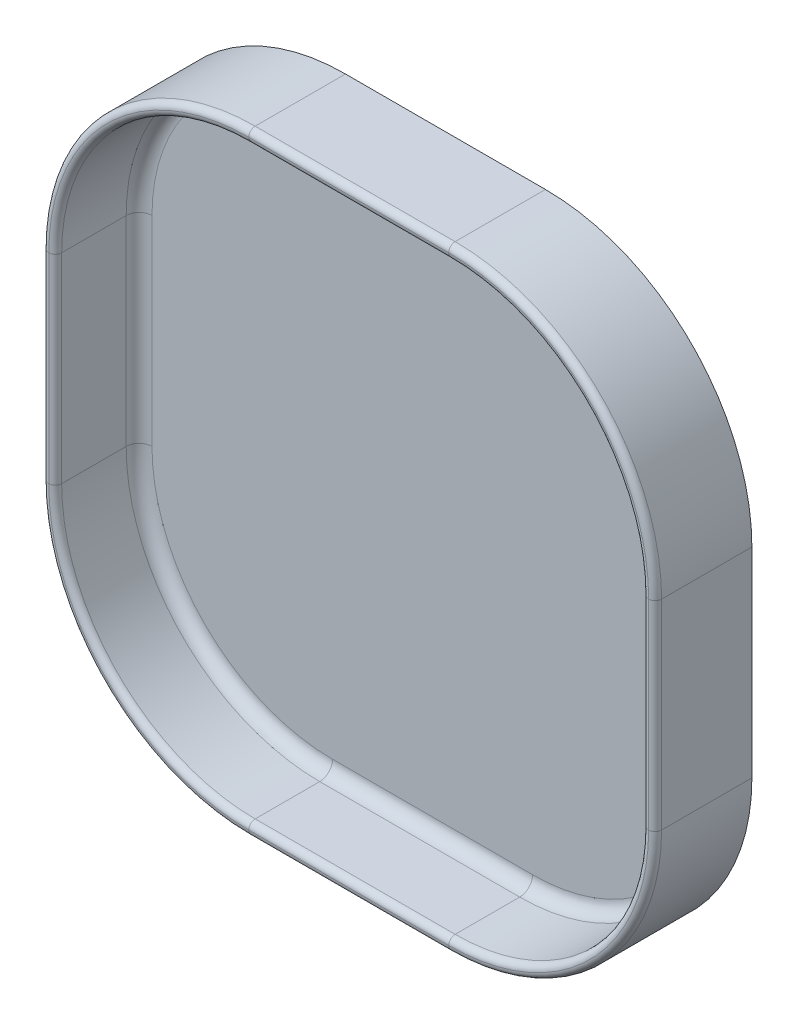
ISO-10303-21;
HEADER;
FILE_DESCRIPTION(('STEP AP214'),'2;1');
FILE_NAME('part.step','',(''),(''),'','','');
FILE_SCHEMA(('AUTOMOTIVE_DESIGN { 1 0 10303 214 1 1 1 1 }'));
ENDSEC;
DATA;
#1=APPLICATION_CONTEXT('core data for automotive mechanical design processes');
#2=APPLICATION_PROTOCOL_DEFINITION('international standard','automotive_design',2000,#1);
#3=PRODUCT_CONTEXT('',#1,'mechanical');
#4=PRODUCT('Part','Part','',(#3));
#5=PRODUCT_RELATED_PRODUCT_CATEGORY('part','',(#4));
#6=PRODUCT_DEFINITION_FORMATION('','',#4);
#7=PRODUCT_DEFINITION_CONTEXT('part definition',#1,'design');
#8=PRODUCT_DEFINITION('design','',#6,#7);
#9=PRODUCT_DEFINITION_SHAPE('','',#8);
#10=(LENGTH_UNIT() NAMED_UNIT(*) SI_UNIT(.MILLI.,.METRE.));
#11=(NAMED_UNIT(*) PLANE_ANGLE_UNIT() SI_UNIT($,.RADIAN.));
#12=(NAMED_UNIT(*) SI_UNIT($,.STERADIAN.) SOLID_ANGLE_UNIT());
#13=UNCERTAINTY_MEASURE_WITH_UNIT(LENGTH_MEASURE(1.E-05),#10,'distance_accuracy_value','');
#14=(GEOMETRIC_REPRESENTATION_CONTEXT(3) GLOBAL_UNCERTAINTY_ASSIGNED_CONTEXT((#13)) GLOBAL_UNIT_ASSIGNED_CONTEXT((#10,
#11,#12)) REPRESENTATION_CONTEXT('',''));
#15=CARTESIAN_POINT('',(0.,0.,0.));
#16=DIRECTION('',(0.,0.,1.));
#17=DIRECTION('',(1.,0.,0.));
#18=AXIS2_PLACEMENT_3D('',#15,#16,#17);
#19=CARTESIAN_POINT('',(-47.5000000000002,54.9999999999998,7.50000000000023));
#20=DIRECTION('',(0.,-1.,0.));
#21=DIRECTION('',(1.,0.,0.));
#22=AXIS2_PLACEMENT_3D('',#19,#20,#21);
#23=PLANE('',#22);
#24=DIRECTION('',(0.,0.,-1.));
#25=VECTOR('',#24,1.);
#26=CARTESIAN_POINT('',(-15.5000000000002,54.9999999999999,7.50000000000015));
#27=LINE('',#26,#25);
#28=CARTESIAN_POINT('',(-15.5000000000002,55.,-7.49999999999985));
#29=VERTEX_POINT('',#28);
#30=CARTESIAN_POINT('',(-15.5000000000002,54.9999999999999,6.50000000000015));
#31=VERTEX_POINT('',#30);
#32=EDGE_CURVE('E396',#29,#31,#27,.F.);
#33=ORIENTED_EDGE('',*,*,#32,.T.);
#34=DIRECTION('',(-1.,0.,0.));
#35=VECTOR('',#34,1.);
#36=CARTESIAN_POINT('',(15.4999999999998,55.,6.50000000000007));
#37=LINE('',#36,#35);
#38=CARTESIAN_POINT('',(15.4999999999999,55.,6.50000000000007));
#39=VERTEX_POINT('',#38);
#40=EDGE_CURVE('E414',#31,#39,#37,.F.);
#41=ORIENTED_EDGE('',*,*,#40,.T.);
#42=DIRECTION('',(0.,0.,-1.));
#43=VECTOR('',#42,1.);
#44=CARTESIAN_POINT('',(15.4999999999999,55.,7.50000000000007));
#45=LINE('',#44,#43);
#46=CARTESIAN_POINT('',(15.4999999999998,55.0000000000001,-7.49999999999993));
#47=VERTEX_POINT('',#46);
#48=EDGE_CURVE('E393',#39,#47,#45,.T.);
#49=ORIENTED_EDGE('',*,*,#48,.T.);
#50=DIRECTION('',(-1.,0.,0.));
#51=VECTOR('',#50,1.);
#52=CARTESIAN_POINT('',(-47.5000000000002,54.9999999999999,-7.49999999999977));
#53=LINE('',#52,#51);
#54=EDGE_CURVE('E374',#47,#29,#53,.T.);
#55=ORIENTED_EDGE('',*,*,#54,.T.);
#56=EDGE_LOOP('',(#33,#41,#49,#55));
#57=FACE_BOUND('',#56,.T.);
#58=ADVANCED_FACE('F36',(#57),#23,.F.);
#59=CARTESIAN_POINT('',(-47.4999999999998,-40.0000000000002,7.49999999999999));
#60=DIRECTION('',(1.,0.,0.));
#61=DIRECTION('',(0.,1.,0.));
#62=AXIS2_PLACEMENT_3D('',#59,#60,#61);
#63=PLANE('',#62);
#64=DIRECTION('',(0.,0.,-1.));
#65=VECTOR('',#64,1.);
#66=CARTESIAN_POINT('',(-47.5,-8.00000000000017,7.50000000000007));
#67=LINE('',#66,#65);
#68=CARTESIAN_POINT('',(-47.5,-8.00000000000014,-7.49999999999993));
#69=VERTEX_POINT('',#68);
#70=CARTESIAN_POINT('',(-47.5,-8.00000000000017,6.50000000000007));
#71=VERTEX_POINT('',#70);
#72=EDGE_CURVE('E375',#69,#71,#67,.F.);
#73=ORIENTED_EDGE('',*,*,#72,.T.);
#74=DIRECTION('',(0.,-1.,0.));
#75=VECTOR('',#74,1.);
#76=CARTESIAN_POINT('',(-47.5000000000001,22.9999999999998,6.50000000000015));
#77=LINE('',#76,#75);
#78=CARTESIAN_POINT('',(-47.5000000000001,22.9999999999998,6.50000000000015));
#79=VERTEX_POINT('',#78);
#80=EDGE_CURVE('E433',#71,#79,#77,.F.);
#81=ORIENTED_EDGE('',*,*,#80,.T.);
#82=DIRECTION('',(0.,0.,-1.));
#83=VECTOR('',#82,1.);
#84=CARTESIAN_POINT('',(-47.5000000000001,22.9999999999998,7.50000000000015));
#85=LINE('',#84,#83);
#86=CARTESIAN_POINT('',(-47.5000000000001,22.9999999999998,-7.49999999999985));
#87=VERTEX_POINT('',#86);
#88=EDGE_CURVE('E379',#79,#87,#85,.T.);
#89=ORIENTED_EDGE('',*,*,#88,.T.);
#90=DIRECTION('',(0.,-1.,0.));
#91=VECTOR('',#90,1.);
#92=CARTESIAN_POINT('',(-47.4999999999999,-40.0000000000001,-7.50000000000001));
#93=LINE('',#92,#91);
#94=EDGE_CURVE('E602',#87,#69,#93,.T.);
#95=ORIENTED_EDGE('',*,*,#94,.T.);
#96=EDGE_LOOP('',(#73,#81,#89,#95));
#97=FACE_BOUND('',#96,.T.);
#98=ADVANCED_FACE('F621',(#97),#63,.F.);
#99=CARTESIAN_POINT('',(-47.4999999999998,-40.0000000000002,7.49999999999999));
#100=DIRECTION('',(0.,1.,0.));
#101=DIRECTION('',(-1.,0.,0.));
#102=AXIS2_PLACEMENT_3D('',#99,#100,#101);
#103=PLANE('',#102);
#104=DIRECTION('',(0.,0.,-1.));
#105=VECTOR('',#104,1.);
#106=CARTESIAN_POINT('',(15.5000000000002,-40.,7.49999999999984));
#107=LINE('',#106,#105);
#108=CARTESIAN_POINT('',(15.5000000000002,-39.9999999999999,-7.50000000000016));
#109=VERTEX_POINT('',#108);
#110=CARTESIAN_POINT('',(15.5000000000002,-40.,6.49999999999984));
#111=VERTEX_POINT('',#110);
#112=EDGE_CURVE('E410',#109,#111,#107,.F.);
#113=ORIENTED_EDGE('',*,*,#112,.T.);
#114=DIRECTION('',(1.,0.,0.));
#115=VECTOR('',#114,1.);
#116=CARTESIAN_POINT('',(-15.4999999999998,-40.0000000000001,6.49999999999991));
#117=LINE('',#116,#115);
#118=CARTESIAN_POINT('',(-15.4999999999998,-40.0000000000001,6.49999999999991));
#119=VERTEX_POINT('',#118);
#120=EDGE_CURVE('E427',#111,#119,#117,.F.);
#121=ORIENTED_EDGE('',*,*,#120,.T.);
#122=DIRECTION('',(0.,0.,-1.));
#123=VECTOR('',#122,1.);
#124=CARTESIAN_POINT('',(-15.4999999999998,-40.0000000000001,7.49999999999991));
#125=LINE('',#124,#123);
#126=CARTESIAN_POINT('',(-15.4999999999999,-40.,-7.50000000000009));
#127=VERTEX_POINT('',#126);
#128=EDGE_CURVE('E407',#119,#127,#125,.T.);
#129=ORIENTED_EDGE('',*,*,#128,.T.);
#130=DIRECTION('',(1.,0.,0.));
#131=VECTOR('',#130,1.);
#132=CARTESIAN_POINT('',(-47.4999999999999,-40.0000000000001,-7.50000000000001));
#133=LINE('',#132,#131);
#134=EDGE_CURVE('E599',#127,#109,#133,.T.);
#135=ORIENTED_EDGE('',*,*,#134,.T.);
#136=EDGE_LOOP('',(#113,#121,#129,#135));
#137=FACE_BOUND('',#136,.T.);
#138=ADVANCED_FACE('F644',(#137),#103,.F.);
#139=CARTESIAN_POINT('',(47.5000000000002,-39.9999999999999,7.49999999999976));
#140=DIRECTION('',(-1.,0.,0.));
#141=DIRECTION('',(0.,-1.,0.));
#142=AXIS2_PLACEMENT_3D('',#139,#140,#141);
#143=PLANE('',#142);
#144=DIRECTION('',(0.,0.,-1.));
#145=VECTOR('',#144,1.);
#146=CARTESIAN_POINT('',(47.5,23.0000000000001,7.49999999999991));
#147=LINE('',#146,#145);
#148=CARTESIAN_POINT('',(47.4999999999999,23.0000000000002,-7.50000000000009));
#149=VERTEX_POINT('',#148);
#150=CARTESIAN_POINT('',(47.5,23.0000000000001,6.49999999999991));
#151=VERTEX_POINT('',#150);
#152=EDGE_CURVE('E400',#149,#151,#147,.F.);
#153=ORIENTED_EDGE('',*,*,#152,.T.);
#154=DIRECTION('',(0.,1.,0.));
#155=VECTOR('',#154,1.);
#156=CARTESIAN_POINT('',(47.5000000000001,-7.99999999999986,6.49999999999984));
#157=LINE('',#156,#155);
#158=CARTESIAN_POINT('',(47.5000000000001,-7.99999999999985,6.49999999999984));
#159=VERTEX_POINT('',#158);
#160=EDGE_CURVE('E421',#151,#159,#157,.F.);
#161=ORIENTED_EDGE('',*,*,#160,.T.);
#162=DIRECTION('',(0.,0.,-1.));
#163=VECTOR('',#162,1.);
#164=CARTESIAN_POINT('',(47.5000000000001,-7.99999999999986,7.49999999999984));
#165=LINE('',#164,#163);
#166=CARTESIAN_POINT('',(47.5,-7.99999999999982,-7.50000000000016));
#167=VERTEX_POINT('',#166);
#168=EDGE_CURVE('E404',#159,#167,#165,.T.);
#169=ORIENTED_EDGE('',*,*,#168,.T.);
#170=DIRECTION('',(0.,1.,0.));
#171=VECTOR('',#170,1.);
#172=CARTESIAN_POINT('',(47.5000000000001,-39.9999999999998,-7.50000000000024));
#173=LINE('',#172,#171);
#174=EDGE_CURVE('E234',#167,#149,#173,.T.);
#175=ORIENTED_EDGE('',*,*,#174,.T.);
#176=EDGE_LOOP('',(#153,#161,#169,#175));
#177=FACE_BOUND('',#176,.T.);
#178=ADVANCED_FACE('F967',(#177),#143,.F.);
#179=CARTESIAN_POINT('',(0.,7.50000000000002,-7.50000000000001));
#180=DIRECTION('',(0.,0.,1.));
#181=DIRECTION('',(1.,0.,0.));
#182=AXIS2_PLACEMENT_3D('',#179,#180,#181);
#183=PLANE('',#182);
#184=ORIENTED_EDGE('',*,*,#94,.F.);
#185=CARTESIAN_POINT('',(-15.5000000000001,23.,-7.49999999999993));
#186=DIRECTION('',(0.,0.,1.));
#187=DIRECTION('',(0.707106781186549,-0.707106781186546,0.));
#188=AXIS2_PLACEMENT_3D('',#185,#186,#187);
#189=CIRCLE('',#188,32.);
#190=EDGE_CURVE('E391',#87,#29,#189,.F.);
#191=ORIENTED_EDGE('',*,*,#190,.T.);
#192=ORIENTED_EDGE('',*,*,#54,.F.);
#193=CARTESIAN_POINT('',(15.4999999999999,23.0000000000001,-7.50000000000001));
#194=DIRECTION('',(0.,0.,1.));
#195=DIRECTION('',(0.707106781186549,-0.707106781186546,0.));
#196=AXIS2_PLACEMENT_3D('',#193,#194,#195);
#197=CIRCLE('',#196,32.);
#198=EDGE_CURVE('E385',#47,#149,#197,.F.);
#199=ORIENTED_EDGE('',*,*,#198,.T.);
#200=ORIENTED_EDGE('',*,*,#174,.F.);
#201=CARTESIAN_POINT('',(15.5,-7.99999999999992,-7.50000000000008));
#202=DIRECTION('',(0.,0.,1.));
#203=DIRECTION('',(0.707106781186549,-0.707106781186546,0.));
#204=AXIS2_PLACEMENT_3D('',#201,#202,#203);
#205=CIRCLE('',#204,32.);
#206=EDGE_CURVE('E388',#167,#109,#205,.F.);
#207=ORIENTED_EDGE('',*,*,#206,.T.);
#208=ORIENTED_EDGE('',*,*,#134,.F.);
#209=CARTESIAN_POINT('',(-15.5,-8.00000000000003,-7.50000000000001));
#210=DIRECTION('',(0.,0.,1.));
#211=DIRECTION('',(0.707106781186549,-0.707106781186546,0.));
#212=AXIS2_PLACEMENT_3D('',#209,#210,#211);
#213=CIRCLE('',#212,32.);
#214=EDGE_CURVE('E382',#127,#69,#213,.F.);
#215=ORIENTED_EDGE('',*,*,#214,.T.);
#216=EDGE_LOOP('',(#184,#191,#192,#199,#200,#207,#208,#215));
#217=FACE_BOUND('',#216,.T.);
#218=ADVANCED_FACE('F959',(#217),#183,.F.);
#219=CARTESIAN_POINT('',(-45.5000000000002,52.9999999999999,-5.49999999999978));
#220=DIRECTION('',(0.,1.,0.));
#221=DIRECTION('',(-1.,0.,0.));
#222=AXIS2_PLACEMENT_3D('',#219,#220,#221);
#223=PLANE('',#222);
#224=DIRECTION('',(0.,0.,1.));
#225=VECTOR('',#224,1.);
#226=CARTESIAN_POINT('',(15.4999999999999,53.,7.50000000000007));
#227=LINE('',#226,#225);
#228=CARTESIAN_POINT('',(15.4999999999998,53.0000000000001,-3.49999999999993));
#229=VERTEX_POINT('',#228);
#230=CARTESIAN_POINT('',(15.4999999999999,53.,6.50000000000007));
#231=VERTEX_POINT('',#230);
#232=EDGE_CURVE('E502',#229,#231,#227,.T.);
#233=ORIENTED_EDGE('',*,*,#232,.T.);
#234=DIRECTION('',(-1.,0.,0.));
#235=VECTOR('',#234,1.);
#236=CARTESIAN_POINT('',(-15.5000000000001,53.,6.50000000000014));
#237=LINE('',#236,#235);
#238=CARTESIAN_POINT('',(-15.5000000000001,52.9999999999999,6.50000000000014));
#239=VERTEX_POINT('',#238);
#240=EDGE_CURVE('E56',#231,#239,#237,.T.);
#241=ORIENTED_EDGE('',*,*,#240,.T.);
#242=DIRECTION('',(0.,0.,1.));
#243=VECTOR('',#242,1.);
#244=CARTESIAN_POINT('',(-15.5000000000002,53.,-5.49999999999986));
#245=LINE('',#244,#243);
#246=CARTESIAN_POINT('',(-15.5000000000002,53.,-3.49999999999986));
#247=VERTEX_POINT('',#246);
#248=EDGE_CURVE('E509',#239,#247,#245,.F.);
#249=ORIENTED_EDGE('',*,*,#248,.T.);
#250=DIRECTION('',(-1.,0.,0.));
#251=VECTOR('',#250,1.);
#252=CARTESIAN_POINT('',(-45.5000000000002,52.9999999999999,-3.49999999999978));
#253=LINE('',#252,#251);
#254=EDGE_CURVE('E540',#247,#229,#253,.F.);
#255=ORIENTED_EDGE('',*,*,#254,.T.);
#256=EDGE_LOOP('',(#233,#241,#249,#255));
#257=FACE_BOUND('',#256,.T.);
#258=ADVANCED_FACE('F569',(#257),#223,.F.);
#259=CARTESIAN_POINT('',(45.5000000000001,-37.9999999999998,-5.50000000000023));
#260=DIRECTION('',(1.,0.,0.));
#261=DIRECTION('',(0.,1.,0.));
#262=AXIS2_PLACEMENT_3D('',#259,#260,#261);
#263=PLANE('',#262);
#264=DIRECTION('',(0.,0.,1.));
#265=VECTOR('',#264,1.);
#266=CARTESIAN_POINT('',(45.5000000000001,-7.99999999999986,7.49999999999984));
#267=LINE('',#266,#265);
#268=CARTESIAN_POINT('',(45.5,-7.99999999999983,-3.50000000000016));
#269=VERTEX_POINT('',#268);
#270=CARTESIAN_POINT('',(45.5000000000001,-7.99999999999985,6.49999999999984));
#271=VERTEX_POINT('',#270);
#272=EDGE_CURVE('E217',#269,#271,#267,.T.);
#273=ORIENTED_EDGE('',*,*,#272,.T.);
#274=DIRECTION('',(0.,1.,0.));
#275=VECTOR('',#274,1.);
#276=CARTESIAN_POINT('',(45.5,23.0000000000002,6.49999999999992));
#277=LINE('',#276,#275);
#278=CARTESIAN_POINT('',(45.5,23.0000000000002,6.49999999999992));
#279=VERTEX_POINT('',#278);
#280=EDGE_CURVE('E211',#271,#279,#277,.T.);
#281=ORIENTED_EDGE('',*,*,#280,.T.);
#282=DIRECTION('',(0.,0.,1.));
#283=VECTOR('',#282,1.);
#284=CARTESIAN_POINT('',(45.4999999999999,23.0000000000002,-5.50000000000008));
#285=LINE('',#284,#283);
#286=CARTESIAN_POINT('',(45.4999999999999,23.0000000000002,-3.50000000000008));
#287=VERTEX_POINT('',#286);
#288=EDGE_CURVE('E214',#279,#287,#285,.F.);
#289=ORIENTED_EDGE('',*,*,#288,.T.);
#290=DIRECTION('',(0.,1.,0.));
#291=VECTOR('',#290,1.);
#292=CARTESIAN_POINT('',(45.5000000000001,-37.9999999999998,-3.50000000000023));
#293=LINE('',#292,#291);
#294=EDGE_CURVE('E544',#287,#269,#293,.F.);
#295=ORIENTED_EDGE('',*,*,#294,.T.);
#296=EDGE_LOOP('',(#273,#281,#289,#295));
#297=FACE_BOUND('',#296,.T.);
#298=ADVANCED_FACE('F213',(#297),#263,.F.);
#299=CARTESIAN_POINT('',(-45.4999999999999,-38.0000000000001,-5.50000000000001));
#300=DIRECTION('',(0.,-1.,0.));
#301=DIRECTION('',(1.,0.,0.));
#302=AXIS2_PLACEMENT_3D('',#299,#300,#301);
#303=PLANE('',#302);
#304=DIRECTION('',(0.,0.,1.));
#305=VECTOR('',#304,1.);
#306=CARTESIAN_POINT('',(-15.4999999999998,-38.0000000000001,7.49999999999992));
#307=LINE('',#306,#305);
#308=CARTESIAN_POINT('',(-15.4999999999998,-38.,-3.50000000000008));
#309=VERTEX_POINT('',#308);
#310=CARTESIAN_POINT('',(-15.4999999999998,-38.0000000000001,6.49999999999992));
#311=VERTEX_POINT('',#310);
#312=EDGE_CURVE('E588',#309,#311,#307,.T.);
#313=ORIENTED_EDGE('',*,*,#312,.T.);
#314=DIRECTION('',(1.,0.,0.));
#315=VECTOR('',#314,1.);
#316=CARTESIAN_POINT('',(15.5000000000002,-38.,6.49999999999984));
#317=LINE('',#316,#315);
#318=CARTESIAN_POINT('',(15.5000000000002,-38.,6.49999999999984));
#319=VERTEX_POINT('',#318);
#320=EDGE_CURVE('E443',#311,#319,#317,.T.);
#321=ORIENTED_EDGE('',*,*,#320,.T.);
#322=DIRECTION('',(0.,0.,1.));
#323=VECTOR('',#322,1.);
#324=CARTESIAN_POINT('',(15.5000000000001,-37.9999999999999,-5.50000000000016));
#325=LINE('',#324,#323);
#326=CARTESIAN_POINT('',(15.5000000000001,-37.9999999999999,-3.50000000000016));
#327=VERTEX_POINT('',#326);
#328=EDGE_CURVE('E453',#319,#327,#325,.F.);
#329=ORIENTED_EDGE('',*,*,#328,.T.);
#330=DIRECTION('',(1.,0.,0.));
#331=VECTOR('',#330,1.);
#332=CARTESIAN_POINT('',(-45.4999999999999,-38.0000000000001,-3.50000000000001));
#333=LINE('',#332,#331);
#334=EDGE_CURVE('E549',#327,#309,#333,.F.);
#335=ORIENTED_EDGE('',*,*,#334,.T.);
#336=EDGE_LOOP('',(#313,#321,#329,#335));
#337=FACE_BOUND('',#336,.T.);
#338=ADVANCED_FACE('F587',(#337),#303,.F.);
#339=CARTESIAN_POINT('',(-45.4999999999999,-38.0000000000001,-5.50000000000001));
#340=DIRECTION('',(-1.,0.,0.));
#341=DIRECTION('',(0.,-1.,0.));
#342=AXIS2_PLACEMENT_3D('',#339,#340,#341);
#343=PLANE('',#342);
#344=DIRECTION('',(0.,0.,1.));
#345=VECTOR('',#344,1.);
#346=CARTESIAN_POINT('',(-45.5,22.9999999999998,7.50000000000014));
#347=LINE('',#346,#345);
#348=CARTESIAN_POINT('',(-45.5000000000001,22.9999999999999,-3.49999999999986));
#349=VERTEX_POINT('',#348);
#350=CARTESIAN_POINT('',(-45.5,22.9999999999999,6.50000000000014));
#351=VERTEX_POINT('',#350);
#352=EDGE_CURVE('E493',#349,#351,#347,.T.);
#353=ORIENTED_EDGE('',*,*,#352,.T.);
#354=DIRECTION('',(0.,-1.,0.));
#355=VECTOR('',#354,1.);
#356=CARTESIAN_POINT('',(-45.4999999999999,-8.00000000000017,6.50000000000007));
#357=LINE('',#356,#355);
#358=CARTESIAN_POINT('',(-45.4999999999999,-8.00000000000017,6.50000000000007));
#359=VERTEX_POINT('',#358);
#360=EDGE_CURVE('E436',#351,#359,#357,.T.);
#361=ORIENTED_EDGE('',*,*,#360,.T.);
#362=DIRECTION('',(0.,0.,1.));
#363=VECTOR('',#362,1.);
#364=CARTESIAN_POINT('',(-45.5,-8.00000000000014,-5.49999999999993));
#365=LINE('',#364,#363);
#366=CARTESIAN_POINT('',(-45.4999999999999,-8.00000000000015,-3.49999999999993));
#367=VERTEX_POINT('',#366);
#368=EDGE_CURVE('E490',#359,#367,#365,.F.);
#369=ORIENTED_EDGE('',*,*,#368,.T.);
#370=DIRECTION('',(0.,-1.,0.));
#371=VECTOR('',#370,1.);
#372=CARTESIAN_POINT('',(-45.4999999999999,-38.0000000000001,-3.50000000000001));
#373=LINE('',#372,#371);
#374=EDGE_CURVE('E350',#367,#349,#373,.F.);
#375=ORIENTED_EDGE('',*,*,#374,.T.);
#376=EDGE_LOOP('',(#353,#361,#369,#375));
#377=FACE_BOUND('',#376,.T.);
#378=ADVANCED_FACE('F489',(#377),#343,.F.);
#379=CARTESIAN_POINT('',(0.,7.50000000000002,-5.50000000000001));
#380=DIRECTION('',(0.,0.,1.));
#381=DIRECTION('',(1.,0.,0.));
#382=AXIS2_PLACEMENT_3D('',#379,#380,#381);
#383=PLANE('',#382);
#384=DIRECTION('',(-1.,0.,0.));
#385=VECTOR('',#384,1.);
#386=CARTESIAN_POINT('',(-1.67400815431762E-13,51.,-5.4999999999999));
#387=LINE('',#386,#385);
#388=CARTESIAN_POINT('',(15.4999999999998,51.0000000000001,-5.49999999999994));
#389=VERTEX_POINT('',#388);
#390=CARTESIAN_POINT('',(-15.5000000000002,51.,-5.49999999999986));
#391=VERTEX_POINT('',#390);
#392=EDGE_CURVE('E530',#389,#391,#387,.T.);
#393=ORIENTED_EDGE('',*,*,#392,.T.);
#394=CARTESIAN_POINT('',(-15.5000000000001,23.,-5.49999999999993));
#395=DIRECTION('',(0.,0.,1.));
#396=DIRECTION('',(1.,0.,0.));
#397=AXIS2_PLACEMENT_3D('',#394,#395,#396);
#398=CIRCLE('',#397,28.);
#399=CARTESIAN_POINT('',(-43.5000000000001,22.9999999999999,-5.49999999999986));
#400=VERTEX_POINT('',#399);
#401=EDGE_CURVE('E533',#391,#400,#398,.T.);
#402=ORIENTED_EDGE('',*,*,#401,.T.);
#403=DIRECTION('',(0.,-1.,0.));
#404=VECTOR('',#403,1.);
#405=CARTESIAN_POINT('',(-43.5,7.49999999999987,-5.4999999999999));
#406=LINE('',#405,#404);
#407=CARTESIAN_POINT('',(-43.5,-8.00000000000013,-5.49999999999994));
#408=VERTEX_POINT('',#407);
#409=EDGE_CURVE('E506',#400,#408,#406,.T.);
#410=ORIENTED_EDGE('',*,*,#409,.T.);
#411=CARTESIAN_POINT('',(-15.5,-8.00000000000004,-5.50000000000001));
#412=DIRECTION('',(0.,0.,1.));
#413=DIRECTION('',(1.,0.,0.));
#414=AXIS2_PLACEMENT_3D('',#411,#412,#413);
#415=CIRCLE('',#414,28.);
#416=CARTESIAN_POINT('',(-15.4999999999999,-36.,-5.50000000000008));
#417=VERTEX_POINT('',#416);
#418=EDGE_CURVE('E515',#408,#417,#415,.T.);
#419=ORIENTED_EDGE('',*,*,#418,.T.);
#420=DIRECTION('',(1.,0.,0.));
#421=VECTOR('',#420,1.);
#422=CARTESIAN_POINT('',(1.37910516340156E-13,-36.,-5.50000000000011));
#423=LINE('',#422,#421);
#424=CARTESIAN_POINT('',(15.5000000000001,-35.9999999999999,-5.50000000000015));
#425=VERTEX_POINT('',#424);
#426=EDGE_CURVE('E518',#417,#425,#423,.T.);
#427=ORIENTED_EDGE('',*,*,#426,.T.);
#428=CARTESIAN_POINT('',(15.5,-7.99999999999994,-5.50000000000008));
#429=DIRECTION('',(0.,0.,1.));
#430=DIRECTION('',(1.,0.,0.));
#431=AXIS2_PLACEMENT_3D('',#428,#429,#430);
#432=CIRCLE('',#431,28.);
#433=CARTESIAN_POINT('',(43.5,-7.99999999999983,-5.50000000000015));
#434=VERTEX_POINT('',#433);
#435=EDGE_CURVE('E521',#425,#434,#432,.T.);
#436=ORIENTED_EDGE('',*,*,#435,.T.);
#437=DIRECTION('',(0.,1.,0.));
#438=VECTOR('',#437,1.);
#439=CARTESIAN_POINT('',(43.5,7.50000000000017,-5.50000000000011));
#440=LINE('',#439,#438);
#441=CARTESIAN_POINT('',(43.4999999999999,23.0000000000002,-5.50000000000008));
#442=VERTEX_POINT('',#441);
#443=EDGE_CURVE('E524',#434,#442,#440,.T.);
#444=ORIENTED_EDGE('',*,*,#443,.T.);
#445=CARTESIAN_POINT('',(15.4999999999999,23.0000000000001,-5.50000000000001));
#446=DIRECTION('',(0.,0.,1.));
#447=DIRECTION('',(1.,0.,0.));
#448=AXIS2_PLACEMENT_3D('',#445,#446,#447);
#449=CIRCLE('',#448,28.);
#450=EDGE_CURVE('E527',#442,#389,#449,.T.);
#451=ORIENTED_EDGE('',*,*,#450,.T.);
#452=EDGE_LOOP('',(#393,#402,#410,#419,#427,#436,#444,#451));
#453=FACE_BOUND('',#452,.T.);
#454=ADVANCED_FACE('F563',(#453),#383,.T.);
#455=CARTESIAN_POINT('',(15.5,-7.99999999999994,-5.50000000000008));
#456=DIRECTION('',(0.,0.,-1.));
#457=DIRECTION('',(-1.,0.,0.));
#458=AXIS2_PLACEMENT_3D('',#455,#456,#457);
#459=CYLINDRICAL_SURFACE('',#458,30.);
#460=ORIENTED_EDGE('',*,*,#328,.F.);
#461=CARTESIAN_POINT('',(15.5000000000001,-7.99999999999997,6.49999999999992));
#462=DIRECTION('',(0.,0.,1.));
#463=DIRECTION('',(0.707106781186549,-0.707106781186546,0.));
#464=AXIS2_PLACEMENT_3D('',#461,#462,#463);
#465=CIRCLE('',#464,30.);
#466=EDGE_CURVE('E224',#319,#271,#465,.T.);
#467=ORIENTED_EDGE('',*,*,#466,.T.);
#468=ORIENTED_EDGE('',*,*,#272,.F.);
#469=CARTESIAN_POINT('',(15.5,-7.99999999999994,-3.50000000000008));
#470=DIRECTION('',(0.,0.,1.));
#471=DIRECTION('',(1.,0.,0.));
#472=AXIS2_PLACEMENT_3D('',#469,#470,#471);
#473=CIRCLE('',#472,30.);
#474=EDGE_CURVE('E547',#269,#327,#473,.F.);
#475=ORIENTED_EDGE('',*,*,#474,.T.);
#476=EDGE_LOOP('',(#460,#467,#468,#475));
#477=FACE_BOUND('',#476,.T.);
#478=ADVANCED_FACE('F450',(#477),#459,.F.);
#479=CARTESIAN_POINT('',(15.4999999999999,23.0000000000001,-5.50000000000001));
#480=DIRECTION('',(0.,0.,-1.));
#481=DIRECTION('',(-1.,0.,0.));
#482=AXIS2_PLACEMENT_3D('',#479,#480,#481);
#483=CYLINDRICAL_SURFACE('',#482,30.);
#484=ORIENTED_EDGE('',*,*,#288,.F.);
#485=CARTESIAN_POINT('',(15.5,23.0000000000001,6.49999999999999));
#486=DIRECTION('',(0.,0.,1.));
#487=DIRECTION('',(0.707106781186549,-0.707106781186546,0.));
#488=AXIS2_PLACEMENT_3D('',#485,#486,#487);
#489=CIRCLE('',#488,30.);
#490=EDGE_CURVE('E223',#279,#231,#489,.T.);
#491=ORIENTED_EDGE('',*,*,#490,.T.);
#492=ORIENTED_EDGE('',*,*,#232,.F.);
#493=CARTESIAN_POINT('',(15.4999999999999,23.0000000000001,-3.50000000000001));
#494=DIRECTION('',(0.,0.,1.));
#495=DIRECTION('',(1.,0.,0.));
#496=AXIS2_PLACEMENT_3D('',#493,#494,#495);
#497=CIRCLE('',#496,30.);
#498=EDGE_CURVE('E231',#229,#287,#497,.F.);
#499=ORIENTED_EDGE('',*,*,#498,.T.);
#500=EDGE_LOOP('',(#484,#491,#492,#499));
#501=FACE_BOUND('',#500,.T.);
#502=ADVANCED_FACE('F227',(#501),#483,.F.);
#503=CARTESIAN_POINT('',(-15.5000000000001,23.,-5.49999999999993));
#504=DIRECTION('',(0.,0.,-1.));
#505=DIRECTION('',(-1.,0.,0.));
#506=AXIS2_PLACEMENT_3D('',#503,#504,#505);
#507=CYLINDRICAL_SURFACE('',#506,30.);
#508=ORIENTED_EDGE('',*,*,#248,.F.);
#509=CARTESIAN_POINT('',(-15.5,23.,6.50000000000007));
#510=DIRECTION('',(0.,0.,1.));
#511=DIRECTION('',(0.707106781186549,-0.707106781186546,0.));
#512=AXIS2_PLACEMENT_3D('',#509,#510,#511);
#513=CIRCLE('',#512,30.);
#514=EDGE_CURVE('E11',#239,#351,#513,.T.);
#515=ORIENTED_EDGE('',*,*,#514,.T.);
#516=ORIENTED_EDGE('',*,*,#352,.F.);
#517=CARTESIAN_POINT('',(-15.5000000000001,23.,-3.49999999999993));
#518=DIRECTION('',(0.,0.,1.));
#519=DIRECTION('',(1.,0.,0.));
#520=AXIS2_PLACEMENT_3D('',#517,#518,#519);
#521=CIRCLE('',#520,30.);
#522=EDGE_CURVE('E536',#349,#247,#521,.F.);
#523=ORIENTED_EDGE('',*,*,#522,.T.);
#524=EDGE_LOOP('',(#508,#515,#516,#523));
#525=FACE_BOUND('',#524,.T.);
#526=ADVANCED_FACE('F556',(#525),#507,.F.);
#527=CARTESIAN_POINT('',(-15.5,-8.00000000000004,-5.50000000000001));
#528=DIRECTION('',(0.,0.,-1.));
#529=DIRECTION('',(-1.,0.,0.));
#530=AXIS2_PLACEMENT_3D('',#527,#528,#529);
#531=CYLINDRICAL_SURFACE('',#530,30.);
#532=ORIENTED_EDGE('',*,*,#368,.F.);
#533=CARTESIAN_POINT('',(-15.4999999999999,-8.00000000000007,6.49999999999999));
#534=DIRECTION('',(0.,0.,1.));
#535=DIRECTION('',(0.707106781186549,-0.707106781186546,0.));
#536=AXIS2_PLACEMENT_3D('',#533,#534,#535);
#537=CIRCLE('',#536,30.);
#538=EDGE_CURVE('E440',#359,#311,#537,.T.);
#539=ORIENTED_EDGE('',*,*,#538,.T.);
#540=ORIENTED_EDGE('',*,*,#312,.F.);
#541=CARTESIAN_POINT('',(-15.5,-8.00000000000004,-3.50000000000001));
#542=DIRECTION('',(0.,0.,1.));
#543=DIRECTION('',(1.,0.,0.));
#544=AXIS2_PLACEMENT_3D('',#541,#542,#543);
#545=CIRCLE('',#544,30.);
#546=EDGE_CURVE('E499',#309,#367,#545,.F.);
#547=ORIENTED_EDGE('',*,*,#546,.T.);
#548=EDGE_LOOP('',(#532,#539,#540,#547));
#549=FACE_BOUND('',#548,.T.);
#550=ADVANCED_FACE('F495',(#549),#531,.F.);
#551=CARTESIAN_POINT('',(15.5,-7.99999999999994,-3.50000000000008));
#552=DIRECTION('',(0.,0.,1.));
#553=DIRECTION('',(1.,0.,0.));
#554=AXIS2_PLACEMENT_3D('',#551,#552,#553);
#555=TOROIDAL_SURFACE('',#554,28.,2.);
#556=CARTESIAN_POINT('',(15.5000000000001,-36.,-3.50000000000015));
#557=DIRECTION('',(1.,0.,0.));
#558=DIRECTION('',(0.,1.,0.));
#559=AXIS2_PLACEMENT_3D('',#556,#557,#558);
#560=CIRCLE('',#559,2.);
#561=EDGE_CURVE('E366',#327,#425,#560,.T.);
#562=ORIENTED_EDGE('',*,*,#561,.F.);
#563=ORIENTED_EDGE('',*,*,#474,.F.);
#564=CARTESIAN_POINT('',(43.5,-7.99999999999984,-3.50000000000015));
#565=DIRECTION('',(0.,-1.,0.));
#566=DIRECTION('',(1.,0.,0.));
#567=AXIS2_PLACEMENT_3D('',#564,#565,#566);
#568=CIRCLE('',#567,2.);
#569=EDGE_CURVE('E370',#434,#269,#568,.T.);
#570=ORIENTED_EDGE('',*,*,#569,.F.);
#571=ORIENTED_EDGE('',*,*,#435,.F.);
#572=EDGE_LOOP('',(#562,#563,#570,#571));
#573=FACE_BOUND('',#572,.T.);
#574=ADVANCED_FACE('F580',(#573),#555,.F.);
#575=CARTESIAN_POINT('',(43.5,7.50000000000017,-3.50000000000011));
#576=DIRECTION('',(0.,1.,0.));
#577=DIRECTION('',(-1.,0.,0.));
#578=AXIS2_PLACEMENT_3D('',#575,#576,#577);
#579=CYLINDRICAL_SURFACE('',#578,2.);
#580=ORIENTED_EDGE('',*,*,#569,.T.);
#581=ORIENTED_EDGE('',*,*,#294,.F.);
#582=CARTESIAN_POINT('',(43.4999999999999,23.0000000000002,-3.50000000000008));
#583=DIRECTION('',(0.,-1.,0.));
#584=DIRECTION('',(1.,0.,0.));
#585=AXIS2_PLACEMENT_3D('',#582,#583,#584);
#586=CIRCLE('',#585,2.);
#587=EDGE_CURVE('E362',#442,#287,#586,.T.);
#588=ORIENTED_EDGE('',*,*,#587,.F.);
#589=ORIENTED_EDGE('',*,*,#443,.F.);
#590=EDGE_LOOP('',(#580,#581,#588,#589));
#591=FACE_BOUND('',#590,.T.);
#592=ADVANCED_FACE('F575',(#591),#579,.F.);
#593=CARTESIAN_POINT('',(1.44849410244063E-13,-36.,-3.50000000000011));
#594=DIRECTION('',(1.,0.,0.));
#595=DIRECTION('',(0.,1.,0.));
#596=AXIS2_PLACEMENT_3D('',#593,#594,#595);
#597=CYLINDRICAL_SURFACE('',#596,2.);
#598=ORIENTED_EDGE('',*,*,#561,.T.);
#599=ORIENTED_EDGE('',*,*,#426,.F.);
#600=CARTESIAN_POINT('',(-15.4999999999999,-36.,-3.50000000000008));
#601=DIRECTION('',(1.,0.,0.));
#602=DIRECTION('',(0.,1.,0.));
#603=AXIS2_PLACEMENT_3D('',#600,#601,#602);
#604=CIRCLE('',#603,2.);
#605=EDGE_CURVE('E359',#309,#417,#604,.T.);
#606=ORIENTED_EDGE('',*,*,#605,.F.);
#607=ORIENTED_EDGE('',*,*,#334,.F.);
#608=EDGE_LOOP('',(#598,#599,#606,#607));
#609=FACE_BOUND('',#608,.T.);
#610=ADVANCED_FACE('F585',(#609),#597,.F.);
#611=CARTESIAN_POINT('',(15.4999999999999,23.0000000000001,-3.50000000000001));
#612=DIRECTION('',(0.,0.,1.));
#613=DIRECTION('',(1.,0.,0.));
#614=AXIS2_PLACEMENT_3D('',#611,#612,#613);
#615=TOROIDAL_SURFACE('',#614,28.,2.);
#616=ORIENTED_EDGE('',*,*,#587,.T.);
#617=ORIENTED_EDGE('',*,*,#498,.F.);
#618=CARTESIAN_POINT('',(15.4999999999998,51.0000000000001,-3.49999999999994));
#619=DIRECTION('',(1.,0.,0.));
#620=DIRECTION('',(0.,1.,0.));
#621=AXIS2_PLACEMENT_3D('',#618,#619,#620);
#622=CIRCLE('',#621,2.);
#623=EDGE_CURVE('E356',#389,#229,#622,.T.);
#624=ORIENTED_EDGE('',*,*,#623,.F.);
#625=ORIENTED_EDGE('',*,*,#450,.F.);
#626=EDGE_LOOP('',(#616,#617,#624,#625));
#627=FACE_BOUND('',#626,.T.);
#628=ADVANCED_FACE('F571',(#627),#615,.F.);
#629=CARTESIAN_POINT('',(-15.5,-8.00000000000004,-3.50000000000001));
#630=DIRECTION('',(0.,0.,1.));
#631=DIRECTION('',(1.,0.,0.));
#632=AXIS2_PLACEMENT_3D('',#629,#630,#631);
#633=TOROIDAL_SURFACE('',#632,28.,2.);
#634=ORIENTED_EDGE('',*,*,#605,.T.);
#635=ORIENTED_EDGE('',*,*,#418,.F.);
#636=CARTESIAN_POINT('',(-43.5,-8.00000000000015,-3.49999999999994));
#637=DIRECTION('',(0.,-1.,0.));
#638=DIRECTION('',(1.,0.,0.));
#639=AXIS2_PLACEMENT_3D('',#636,#637,#638);
#640=CIRCLE('',#639,2.);
#641=EDGE_CURVE('E347',#367,#408,#640,.T.);
#642=ORIENTED_EDGE('',*,*,#641,.F.);
#643=ORIENTED_EDGE('',*,*,#546,.F.);
#644=EDGE_LOOP('',(#634,#635,#642,#643));
#645=FACE_BOUND('',#644,.T.);
#646=ADVANCED_FACE('F662',(#645),#633,.F.);
#647=CARTESIAN_POINT('',(-1.60461921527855E-13,51.,-3.4999999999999));
#648=DIRECTION('',(-1.,0.,0.));
#649=DIRECTION('',(0.,-1.,0.));
#650=AXIS2_PLACEMENT_3D('',#647,#648,#649);
#651=CYLINDRICAL_SURFACE('',#650,2.);
#652=ORIENTED_EDGE('',*,*,#623,.T.);
#653=ORIENTED_EDGE('',*,*,#254,.F.);
#654=CARTESIAN_POINT('',(-15.5000000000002,51.,-3.49999999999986));
#655=DIRECTION('',(1.,0.,0.));
#656=DIRECTION('',(0.,1.,0.));
#657=AXIS2_PLACEMENT_3D('',#654,#655,#656);
#658=CIRCLE('',#657,2.);
#659=EDGE_CURVE('E342',#391,#247,#658,.T.);
#660=ORIENTED_EDGE('',*,*,#659,.F.);
#661=ORIENTED_EDGE('',*,*,#392,.F.);
#662=EDGE_LOOP('',(#652,#653,#660,#661));
#663=FACE_BOUND('',#662,.T.);
#664=ADVANCED_FACE('F568',(#663),#651,.F.);
#665=CARTESIAN_POINT('',(-43.5,7.49999999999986,-3.4999999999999));
#666=DIRECTION('',(0.,-1.,0.));
#667=DIRECTION('',(1.,0.,0.));
#668=AXIS2_PLACEMENT_3D('',#665,#666,#667);
#669=CYLINDRICAL_SURFACE('',#668,2.);
#670=ORIENTED_EDGE('',*,*,#641,.T.);
#671=ORIENTED_EDGE('',*,*,#409,.F.);
#672=CARTESIAN_POINT('',(-43.5000000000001,22.9999999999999,-3.49999999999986));
#673=DIRECTION('',(0.,-1.,0.));
#674=DIRECTION('',(1.,0.,0.));
#675=AXIS2_PLACEMENT_3D('',#672,#673,#674);
#676=CIRCLE('',#675,2.);
#677=EDGE_CURVE('E100',#349,#400,#676,.T.);
#678=ORIENTED_EDGE('',*,*,#677,.F.);
#679=ORIENTED_EDGE('',*,*,#374,.F.);
#680=EDGE_LOOP('',(#670,#671,#678,#679));
#681=FACE_BOUND('',#680,.T.);
#682=ADVANCED_FACE('F560',(#681),#669,.F.);
#683=CARTESIAN_POINT('',(-15.5000000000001,23.,-3.49999999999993));
#684=DIRECTION('',(0.,0.,1.));
#685=DIRECTION('',(1.,0.,0.));
#686=AXIS2_PLACEMENT_3D('',#683,#684,#685);
#687=TOROIDAL_SURFACE('',#686,28.,2.);
#688=ORIENTED_EDGE('',*,*,#659,.T.);
#689=ORIENTED_EDGE('',*,*,#522,.F.);
#690=ORIENTED_EDGE('',*,*,#677,.T.);
#691=ORIENTED_EDGE('',*,*,#401,.F.);
#692=EDGE_LOOP('',(#688,#689,#690,#691));
#693=FACE_BOUND('',#692,.T.);
#694=ADVANCED_FACE('F557',(#693),#687,.F.);
#695=CARTESIAN_POINT('',(-15.5000000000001,22.9999999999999,7.50000000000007));
#696=DIRECTION('',(0.,0.,-1.));
#697=DIRECTION('',(-0.707106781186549,0.707106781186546,0.));
#698=AXIS2_PLACEMENT_3D('',#695,#696,#697);
#699=CYLINDRICAL_SURFACE('',#698,32.);
#700=ORIENTED_EDGE('',*,*,#88,.F.);
#701=CARTESIAN_POINT('',(-15.5000000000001,22.9999999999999,6.50000000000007));
#702=DIRECTION('',(0.,0.,1.));
#703=DIRECTION('',(0.707106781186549,-0.707106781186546,0.));
#704=AXIS2_PLACEMENT_3D('',#701,#702,#703);
#705=CIRCLE('',#704,32.);
#706=EDGE_CURVE('E47',#79,#31,#705,.F.);
#707=ORIENTED_EDGE('',*,*,#706,.T.);
#708=ORIENTED_EDGE('',*,*,#32,.F.);
#709=ORIENTED_EDGE('',*,*,#190,.F.);
#710=EDGE_LOOP('',(#700,#707,#708,#709));
#711=FACE_BOUND('',#710,.T.);
#712=ADVANCED_FACE('F618',(#711),#699,.T.);
#713=CARTESIAN_POINT('',(15.5000000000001,-7.99999999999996,7.49999999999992));
#714=DIRECTION('',(0.,0.,-1.));
#715=DIRECTION('',(-0.707106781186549,0.707106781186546,0.));
#716=AXIS2_PLACEMENT_3D('',#713,#714,#715);
#717=CYLINDRICAL_SURFACE('',#716,32.);
#718=ORIENTED_EDGE('',*,*,#168,.F.);
#719=CARTESIAN_POINT('',(15.5000000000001,-7.99999999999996,6.49999999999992));
#720=DIRECTION('',(0.,0.,1.));
#721=DIRECTION('',(0.707106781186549,-0.707106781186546,0.));
#722=AXIS2_PLACEMENT_3D('',#719,#720,#721);
#723=CIRCLE('',#722,32.);
#724=EDGE_CURVE('E424',#159,#111,#723,.F.);
#725=ORIENTED_EDGE('',*,*,#724,.T.);
#726=ORIENTED_EDGE('',*,*,#112,.F.);
#727=ORIENTED_EDGE('',*,*,#206,.F.);
#728=EDGE_LOOP('',(#718,#725,#726,#727));
#729=FACE_BOUND('',#728,.T.);
#730=ADVANCED_FACE('F676',(#729),#717,.T.);
#731=CARTESIAN_POINT('',(15.5,23.,7.49999999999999));
#732=DIRECTION('',(0.,0.,-1.));
#733=DIRECTION('',(-0.707106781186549,0.707106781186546,0.));
#734=AXIS2_PLACEMENT_3D('',#731,#732,#733);
#735=CYLINDRICAL_SURFACE('',#734,32.);
#736=ORIENTED_EDGE('',*,*,#48,.F.);
#737=CARTESIAN_POINT('',(15.5,23.,6.49999999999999));
#738=DIRECTION('',(0.,0.,1.));
#739=DIRECTION('',(0.707106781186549,-0.707106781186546,0.));
#740=AXIS2_PLACEMENT_3D('',#737,#738,#739);
#741=CIRCLE('',#740,32.);
#742=EDGE_CURVE('E418',#39,#151,#741,.F.);
#743=ORIENTED_EDGE('',*,*,#742,.T.);
#744=ORIENTED_EDGE('',*,*,#152,.F.);
#745=ORIENTED_EDGE('',*,*,#198,.F.);
#746=EDGE_LOOP('',(#736,#743,#744,#745));
#747=FACE_BOUND('',#746,.T.);
#748=ADVANCED_FACE('F679',(#747),#735,.T.);
#749=CARTESIAN_POINT('',(-15.5,-8.00000000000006,7.49999999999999));
#750=DIRECTION('',(0.,0.,-1.));
#751=DIRECTION('',(-0.707106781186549,0.707106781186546,0.));
#752=AXIS2_PLACEMENT_3D('',#749,#750,#751);
#753=CYLINDRICAL_SURFACE('',#752,32.);
#754=ORIENTED_EDGE('',*,*,#128,.F.);
#755=CARTESIAN_POINT('',(-15.5,-8.00000000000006,6.49999999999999));
#756=DIRECTION('',(0.,0.,1.));
#757=DIRECTION('',(0.707106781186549,-0.707106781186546,0.));
#758=AXIS2_PLACEMENT_3D('',#755,#756,#757);
#759=CIRCLE('',#758,32.);
#760=EDGE_CURVE('E430',#119,#71,#759,.F.);
#761=ORIENTED_EDGE('',*,*,#760,.T.);
#762=ORIENTED_EDGE('',*,*,#72,.F.);
#763=ORIENTED_EDGE('',*,*,#214,.F.);
#764=EDGE_LOOP('',(#754,#761,#762,#763));
#765=FACE_BOUND('',#764,.T.);
#766=ADVANCED_FACE('F683',(#765),#753,.T.);
#767=CARTESIAN_POINT('',(-45.4999999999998,-39.0000000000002,6.49999999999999));
#768=DIRECTION('',(-1.,0.,0.));
#769=DIRECTION('',(0.,-1.,0.));
#770=AXIS2_PLACEMENT_3D('',#767,#768,#769);
#771=CYLINDRICAL_SURFACE('',#770,1.);
#772=CARTESIAN_POINT('',(15.5000000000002,-39.,6.49999999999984));
#773=DIRECTION('',(1.,0.,0.));
#774=DIRECTION('',(0.,1.,0.));
#775=AXIS2_PLACEMENT_3D('',#772,#773,#774);
#776=CIRCLE('',#775,1.);
#777=CARTESIAN_POINT('',(15.5000000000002,-39.,7.49999999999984));
#778=VERTEX_POINT('',#777);
#779=EDGE_CURVE('E40',#319,#778,#776,.T.);
#780=ORIENTED_EDGE('',*,*,#779,.F.);
#781=ORIENTED_EDGE('',*,*,#320,.F.);
#782=CARTESIAN_POINT('',(-15.4999999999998,-39.0000000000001,6.49999999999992));
#783=DIRECTION('',(-1.,0.,0.));
#784=DIRECTION('',(0.,-1.,0.));
#785=AXIS2_PLACEMENT_3D('',#782,#783,#784);
#786=CIRCLE('',#785,1.);
#787=CARTESIAN_POINT('',(-15.4999999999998,-39.0000000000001,7.49999999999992));
#788=VERTEX_POINT('',#787);
#789=EDGE_CURVE('E86',#788,#311,#786,.T.);
#790=ORIENTED_EDGE('',*,*,#789,.F.);
#791=DIRECTION('',(1.,0.,0.));
#792=VECTOR('',#791,1.);
#793=CARTESIAN_POINT('',(-15.4999999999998,-39.0000000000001,7.49999999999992));
#794=LINE('',#793,#792);
#795=EDGE_CURVE('E332',#778,#788,#794,.F.);
#796=ORIENTED_EDGE('',*,*,#795,.F.);
#797=EDGE_LOOP('',(#780,#781,#790,#796));
#798=FACE_BOUND('',#797,.T.);
#799=ADVANCED_FACE('F38',(#798),#771,.T.);
#800=CARTESIAN_POINT('',(15.5000000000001,-7.99999999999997,6.49999999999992));
#801=DIRECTION('',(0.,0.,1.));
#802=DIRECTION('',(0.707106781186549,-0.707106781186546,0.));
#803=AXIS2_PLACEMENT_3D('',#800,#801,#802);
#804=TOROIDAL_SURFACE('',#803,31.,1.);
#805=ORIENTED_EDGE('',*,*,#466,.F.);
#806=ORIENTED_EDGE('',*,*,#779,.T.);
#807=CARTESIAN_POINT('',(15.5000000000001,-7.99999999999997,7.49999999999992));
#808=DIRECTION('',(0.,0.,1.));
#809=DIRECTION('',(0.707106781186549,-0.707106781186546,0.));
#810=AXIS2_PLACEMENT_3D('',#807,#808,#809);
#811=CIRCLE('',#810,31.);
#812=CARTESIAN_POINT('',(46.5000000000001,-7.99999999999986,7.49999999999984));
#813=VERTEX_POINT('',#812);
#814=EDGE_CURVE('E324',#813,#778,#811,.F.);
#815=ORIENTED_EDGE('',*,*,#814,.F.);
#816=CARTESIAN_POINT('',(46.5000000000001,-7.99999999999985,6.49999999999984));
#817=DIRECTION('',(0.,1.,0.));
#818=DIRECTION('',(-1.,0.,0.));
#819=AXIS2_PLACEMENT_3D('',#816,#817,#818);
#820=CIRCLE('',#819,1.);
#821=EDGE_CURVE('E321',#271,#813,#820,.T.);
#822=ORIENTED_EDGE('',*,*,#821,.F.);
#823=EDGE_LOOP('',(#805,#806,#815,#822));
#824=FACE_BOUND('',#823,.T.);
#825=ADVANCED_FACE('F454',(#824),#804,.T.);
#826=CARTESIAN_POINT('',(-15.4999999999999,-8.00000000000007,6.49999999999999));
#827=DIRECTION('',(0.,0.,1.));
#828=DIRECTION('',(0.707106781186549,-0.707106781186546,0.));
#829=AXIS2_PLACEMENT_3D('',#826,#827,#828);
#830=TOROIDAL_SURFACE('',#829,31.,1.);
#831=ORIENTED_EDGE('',*,*,#789,.T.);
#832=ORIENTED_EDGE('',*,*,#538,.F.);
#833=CARTESIAN_POINT('',(-46.4999999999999,-8.00000000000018,6.50000000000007));
#834=DIRECTION('',(0.,1.,0.));
#835=DIRECTION('',(-1.,0.,0.));
#836=AXIS2_PLACEMENT_3D('',#833,#834,#835);
#837=CIRCLE('',#836,1.);
#838=CARTESIAN_POINT('',(-46.5,-8.00000000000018,7.50000000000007));
#839=VERTEX_POINT('',#838);
#840=EDGE_CURVE('E318',#839,#359,#837,.T.);
#841=ORIENTED_EDGE('',*,*,#840,.F.);
#842=CARTESIAN_POINT('',(-15.4999999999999,-8.00000000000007,7.49999999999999));
#843=DIRECTION('',(0.,0.,1.));
#844=DIRECTION('',(0.707106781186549,-0.707106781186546,0.));
#845=AXIS2_PLACEMENT_3D('',#842,#843,#844);
#846=CIRCLE('',#845,31.);
#847=EDGE_CURVE('E314',#788,#839,#846,.F.);
#848=ORIENTED_EDGE('',*,*,#847,.F.);
#849=EDGE_LOOP('',(#831,#832,#841,#848));
#850=FACE_BOUND('',#849,.T.);
#851=ADVANCED_FACE('F629',(#850),#830,.T.);
#852=CARTESIAN_POINT('',(1.76074432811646E-13,-39.,6.49999999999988));
#853=DIRECTION('',(-1.,0.,0.));
#854=DIRECTION('',(0.,-1.,0.));
#855=AXIS2_PLACEMENT_3D('',#852,#853,#854);
#856=CYLINDRICAL_SURFACE('',#855,1.);
#857=CARTESIAN_POINT('',(-15.4999999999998,-39.0000000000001,6.49999999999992));
#858=DIRECTION('',(-1.,0.,0.));
#859=DIRECTION('',(0.,-1.,0.));
#860=AXIS2_PLACEMENT_3D('',#857,#858,#859);
#861=CIRCLE('',#860,1.);
#862=EDGE_CURVE('E310',#119,#788,#861,.T.);
#863=ORIENTED_EDGE('',*,*,#862,.F.);
#864=ORIENTED_EDGE('',*,*,#120,.F.);
#865=CARTESIAN_POINT('',(15.5000000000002,-39.,6.49999999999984));
#866=DIRECTION('',(1.,0.,0.));
#867=DIRECTION('',(0.,1.,0.));
#868=AXIS2_PLACEMENT_3D('',#865,#866,#867);
#869=CIRCLE('',#868,1.);
#870=EDGE_CURVE('E328',#778,#111,#869,.T.);
#871=ORIENTED_EDGE('',*,*,#870,.F.);
#872=ORIENTED_EDGE('',*,*,#795,.T.);
#873=EDGE_LOOP('',(#863,#864,#871,#872));
#874=FACE_BOUND('',#873,.T.);
#875=ADVANCED_FACE('F631',(#874),#856,.T.);
#876=CARTESIAN_POINT('',(15.5000000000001,-7.99999999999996,6.49999999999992));
#877=DIRECTION('',(0.,0.,1.));
#878=DIRECTION('',(0.707106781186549,-0.707106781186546,0.));
#879=AXIS2_PLACEMENT_3D('',#876,#877,#878);
#880=TOROIDAL_SURFACE('',#879,31.,1.);
#881=ORIENTED_EDGE('',*,*,#870,.T.);
#882=ORIENTED_EDGE('',*,*,#724,.F.);
#883=CARTESIAN_POINT('',(46.5000000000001,-7.99999999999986,6.49999999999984));
#884=DIRECTION('',(0.,1.,0.));
#885=DIRECTION('',(-1.,0.,0.));
#886=AXIS2_PLACEMENT_3D('',#883,#884,#885);
#887=CIRCLE('',#886,1.);
#888=EDGE_CURVE('E306',#813,#159,#887,.T.);
#889=ORIENTED_EDGE('',*,*,#888,.F.);
#890=ORIENTED_EDGE('',*,*,#814,.T.);
#891=EDGE_LOOP('',(#881,#882,#889,#890));
#892=FACE_BOUND('',#891,.T.);
#893=ADVANCED_FACE('F458',(#892),#880,.T.);
#894=CARTESIAN_POINT('',(46.5000000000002,-37.9999999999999,6.49999999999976));
#895=DIRECTION('',(0.,-1.,0.));
#896=DIRECTION('',(1.,0.,0.));
#897=AXIS2_PLACEMENT_3D('',#894,#895,#896);
#898=CYLINDRICAL_SURFACE('',#897,1.);
#899=ORIENTED_EDGE('',*,*,#280,.F.);
#900=ORIENTED_EDGE('',*,*,#821,.T.);
#901=DIRECTION('',(0.,1.,0.));
#902=VECTOR('',#901,1.);
#903=CARTESIAN_POINT('',(46.5000000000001,-7.99999999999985,7.49999999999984));
#904=LINE('',#903,#902);
#905=CARTESIAN_POINT('',(46.5,23.0000000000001,7.49999999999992));
#906=VERTEX_POINT('',#905);
#907=EDGE_CURVE('E240',#906,#813,#904,.F.);
#908=ORIENTED_EDGE('',*,*,#907,.F.);
#909=CARTESIAN_POINT('',(46.5,23.0000000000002,6.49999999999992));
#910=DIRECTION('',(0.,1.,0.));
#911=DIRECTION('',(-1.,0.,0.));
#912=AXIS2_PLACEMENT_3D('',#909,#910,#911);
#913=CIRCLE('',#912,1.);
#914=EDGE_CURVE('E237',#279,#906,#913,.T.);
#915=ORIENTED_EDGE('',*,*,#914,.F.);
#916=EDGE_LOOP('',(#899,#900,#908,#915));
#917=FACE_BOUND('',#916,.T.);
#918=ADVANCED_FACE('F238',(#917),#898,.T.);
#919=CARTESIAN_POINT('',(-46.4999999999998,-38.0000000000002,6.49999999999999));
#920=DIRECTION('',(0.,1.,0.));
#921=DIRECTION('',(-1.,0.,0.));
#922=AXIS2_PLACEMENT_3D('',#919,#920,#921);
#923=CYLINDRICAL_SURFACE('',#922,1.);
#924=ORIENTED_EDGE('',*,*,#840,.T.);
#925=ORIENTED_EDGE('',*,*,#360,.F.);
#926=CARTESIAN_POINT('',(-46.5,22.9999999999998,6.50000000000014));
#927=DIRECTION('',(0.,1.,0.));
#928=DIRECTION('',(-1.,0.,0.));
#929=AXIS2_PLACEMENT_3D('',#926,#927,#928);
#930=CIRCLE('',#929,1.);
#931=CARTESIAN_POINT('',(-46.5000000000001,22.9999999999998,7.50000000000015));
#932=VERTEX_POINT('',#931);
#933=EDGE_CURVE('E244',#932,#351,#930,.T.);
#934=ORIENTED_EDGE('',*,*,#933,.F.);
#935=DIRECTION('',(0.,-1.,0.));
#936=VECTOR('',#935,1.);
#937=CARTESIAN_POINT('',(-46.5,22.9999999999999,7.50000000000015));
#938=LINE('',#937,#936);
#939=EDGE_CURVE('E297',#839,#932,#938,.F.);
#940=ORIENTED_EDGE('',*,*,#939,.F.);
#941=EDGE_LOOP('',(#924,#925,#934,#940));
#942=FACE_BOUND('',#941,.T.);
#943=ADVANCED_FACE('F484',(#942),#923,.T.);
#944=CARTESIAN_POINT('',(-15.5,-8.00000000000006,6.49999999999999));
#945=DIRECTION('',(0.,0.,1.));
#946=DIRECTION('',(0.707106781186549,-0.707106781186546,0.));
#947=AXIS2_PLACEMENT_3D('',#944,#945,#946);
#948=TOROIDAL_SURFACE('',#947,31.,1.);
#949=ORIENTED_EDGE('',*,*,#862,.T.);
#950=ORIENTED_EDGE('',*,*,#847,.T.);
#951=CARTESIAN_POINT('',(-46.5,-8.00000000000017,6.50000000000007));
#952=DIRECTION('',(0.,1.,0.));
#953=DIRECTION('',(-1.,0.,0.));
#954=AXIS2_PLACEMENT_3D('',#951,#952,#953);
#955=CIRCLE('',#954,1.);
#956=EDGE_CURVE('E293',#71,#839,#955,.T.);
#957=ORIENTED_EDGE('',*,*,#956,.F.);
#958=ORIENTED_EDGE('',*,*,#760,.F.);
#959=EDGE_LOOP('',(#949,#950,#957,#958));
#960=FACE_BOUND('',#959,.T.);
#961=ADVANCED_FACE('F627',(#960),#948,.T.);
#962=CARTESIAN_POINT('',(46.5,7.50000000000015,6.49999999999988));
#963=DIRECTION('',(0.,-1.,0.));
#964=DIRECTION('',(1.,0.,0.));
#965=AXIS2_PLACEMENT_3D('',#962,#963,#964);
#966=CYLINDRICAL_SURFACE('',#965,1.);
#967=ORIENTED_EDGE('',*,*,#888,.T.);
#968=ORIENTED_EDGE('',*,*,#160,.F.);
#969=CARTESIAN_POINT('',(46.5,23.0000000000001,6.49999999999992));
#970=DIRECTION('',(0.,1.,0.));
#971=DIRECTION('',(-1.,0.,0.));
#972=AXIS2_PLACEMENT_3D('',#969,#970,#971);
#973=CIRCLE('',#972,1.);
#974=EDGE_CURVE('E289',#906,#151,#973,.T.);
#975=ORIENTED_EDGE('',*,*,#974,.F.);
#976=ORIENTED_EDGE('',*,*,#907,.T.);
#977=EDGE_LOOP('',(#967,#968,#975,#976));
#978=FACE_BOUND('',#977,.T.);
#979=ADVANCED_FACE('F461',(#978),#966,.T.);
#980=CARTESIAN_POINT('',(15.5,23.0000000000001,6.49999999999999));
#981=DIRECTION('',(0.,0.,1.));
#982=DIRECTION('',(0.707106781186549,-0.707106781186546,0.));
#983=AXIS2_PLACEMENT_3D('',#980,#981,#982);
#984=TOROIDAL_SURFACE('',#983,31.,1.);
#985=ORIENTED_EDGE('',*,*,#490,.F.);
#986=ORIENTED_EDGE('',*,*,#914,.T.);
#987=CARTESIAN_POINT('',(15.5,23.0000000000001,7.49999999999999));
#988=DIRECTION('',(0.,0.,1.));
#989=DIRECTION('',(0.707106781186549,-0.707106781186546,0.));
#990=AXIS2_PLACEMENT_3D('',#987,#988,#989);
#991=CIRCLE('',#990,31.);
#992=CARTESIAN_POINT('',(15.4999999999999,54.,7.50000000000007));
#993=VERTEX_POINT('',#992);
#994=EDGE_CURVE('E285',#993,#906,#991,.F.);
#995=ORIENTED_EDGE('',*,*,#994,.F.);
#996=CARTESIAN_POINT('',(15.4999999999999,54.0000000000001,6.50000000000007));
#997=DIRECTION('',(-1.,0.,0.));
#998=DIRECTION('',(0.,-1.,0.));
#999=AXIS2_PLACEMENT_3D('',#996,#997,#998);
#1000=CIRCLE('',#999,1.);
#1001=EDGE_CURVE('E249',#231,#993,#1000,.T.);
#1002=ORIENTED_EDGE('',*,*,#1001,.F.);
#1003=EDGE_LOOP('',(#985,#986,#995,#1002));
#1004=FACE_BOUND('',#1003,.T.);
#1005=ADVANCED_FACE('F247',(#1004),#984,.T.);
#1006=CARTESIAN_POINT('',(-15.5,23.,6.50000000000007));
#1007=DIRECTION('',(0.,0.,1.));
#1008=DIRECTION('',(0.707106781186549,-0.707106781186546,0.));
#1009=AXIS2_PLACEMENT_3D('',#1006,#1007,#1008);
#1010=TOROIDAL_SURFACE('',#1009,31.,1.);
#1011=ORIENTED_EDGE('',*,*,#933,.T.);
#1012=ORIENTED_EDGE('',*,*,#514,.F.);
#1013=CARTESIAN_POINT('',(-15.5000000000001,53.9999999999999,6.50000000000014));
#1014=DIRECTION('',(1.,0.,0.));
#1015=DIRECTION('',(0.,1.,0.));
#1016=AXIS2_PLACEMENT_3D('',#1013,#1014,#1015);
#1017=CIRCLE('',#1016,1.);
#1018=CARTESIAN_POINT('',(-15.5000000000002,53.9999999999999,7.50000000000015));
#1019=VERTEX_POINT('',#1018);
#1020=EDGE_CURVE('E279',#1019,#239,#1017,.T.);
#1021=ORIENTED_EDGE('',*,*,#1020,.F.);
#1022=CARTESIAN_POINT('',(-15.5,22.9999999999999,7.50000000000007));
#1023=DIRECTION('',(0.,0.,1.));
#1024=DIRECTION('',(0.707106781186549,-0.707106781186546,0.));
#1025=AXIS2_PLACEMENT_3D('',#1022,#1023,#1024);
#1026=CIRCLE('',#1025,31.);
#1027=EDGE_CURVE('E275',#932,#1019,#1026,.F.);
#1028=ORIENTED_EDGE('',*,*,#1027,.F.);
#1029=EDGE_LOOP('',(#1011,#1012,#1021,#1028));
#1030=FACE_BOUND('',#1029,.T.);
#1031=ADVANCED_FACE('F472',(#1030),#1010,.T.);
#1032=CARTESIAN_POINT('',(-46.5,7.49999999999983,6.50000000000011));
#1033=DIRECTION('',(0.,1.,0.));
#1034=DIRECTION('',(-1.,0.,0.));
#1035=AXIS2_PLACEMENT_3D('',#1032,#1033,#1034);
#1036=CYLINDRICAL_SURFACE('',#1035,1.);
#1037=ORIENTED_EDGE('',*,*,#956,.T.);
#1038=ORIENTED_EDGE('',*,*,#939,.T.);
#1039=CARTESIAN_POINT('',(-46.5000000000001,22.9999999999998,6.50000000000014));
#1040=DIRECTION('',(0.,1.,0.));
#1041=DIRECTION('',(-1.,0.,0.));
#1042=AXIS2_PLACEMENT_3D('',#1039,#1040,#1041);
#1043=CIRCLE('',#1042,1.);
#1044=EDGE_CURVE('E271',#79,#932,#1043,.T.);
#1045=ORIENTED_EDGE('',*,*,#1044,.F.);
#1046=ORIENTED_EDGE('',*,*,#80,.F.);
#1047=EDGE_LOOP('',(#1037,#1038,#1045,#1046));
#1048=FACE_BOUND('',#1047,.T.);
#1049=ADVANCED_FACE('F480',(#1048),#1036,.T.);
#1050=CARTESIAN_POINT('',(15.5,23.,6.49999999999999));
#1051=DIRECTION('',(0.,0.,1.));
#1052=DIRECTION('',(0.707106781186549,-0.707106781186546,0.));
#1053=AXIS2_PLACEMENT_3D('',#1050,#1051,#1052);
#1054=TOROIDAL_SURFACE('',#1053,31.,1.);
#1055=ORIENTED_EDGE('',*,*,#974,.T.);
#1056=ORIENTED_EDGE('',*,*,#742,.F.);
#1057=CARTESIAN_POINT('',(15.4999999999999,54.,6.50000000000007));
#1058=DIRECTION('',(-1.,0.,0.));
#1059=DIRECTION('',(0.,-1.,0.));
#1060=AXIS2_PLACEMENT_3D('',#1057,#1058,#1059);
#1061=CIRCLE('',#1060,1.);
#1062=EDGE_CURVE('E268',#993,#39,#1061,.T.);
#1063=ORIENTED_EDGE('',*,*,#1062,.F.);
#1064=ORIENTED_EDGE('',*,*,#994,.T.);
#1065=EDGE_LOOP('',(#1055,#1056,#1063,#1064));
#1066=FACE_BOUND('',#1065,.T.);
#1067=ADVANCED_FACE('F465',(#1066),#1054,.T.);
#1068=CARTESIAN_POINT('',(-45.5000000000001,53.9999999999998,6.50000000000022));
#1069=DIRECTION('',(1.,0.,0.));
#1070=DIRECTION('',(0.,1.,0.));
#1071=AXIS2_PLACEMENT_3D('',#1068,#1069,#1070);
#1072=CYLINDRICAL_SURFACE('',#1071,1.);
#1073=ORIENTED_EDGE('',*,*,#240,.F.);
#1074=ORIENTED_EDGE('',*,*,#1001,.T.);
#1075=DIRECTION('',(-1.,0.,0.));
#1076=VECTOR('',#1075,1.);
#1077=CARTESIAN_POINT('',(15.4999999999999,54.,7.50000000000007));
#1078=LINE('',#1077,#1076);
#1079=EDGE_CURVE('E264',#1019,#993,#1078,.F.);
#1080=ORIENTED_EDGE('',*,*,#1079,.F.);
#1081=ORIENTED_EDGE('',*,*,#1020,.T.);
#1082=EDGE_LOOP('',(#1073,#1074,#1080,#1081));
#1083=FACE_BOUND('',#1082,.T.);
#1084=ADVANCED_FACE('F468',(#1083),#1072,.T.);
#1085=CARTESIAN_POINT('',(-15.5000000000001,22.9999999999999,6.50000000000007));
#1086=DIRECTION('',(0.,0.,1.));
#1087=DIRECTION('',(0.707106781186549,-0.707106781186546,0.));
#1088=AXIS2_PLACEMENT_3D('',#1085,#1086,#1087);
#1089=TOROIDAL_SURFACE('',#1088,31.,1.);
#1090=ORIENTED_EDGE('',*,*,#1044,.T.);
#1091=ORIENTED_EDGE('',*,*,#1027,.T.);
#1092=CARTESIAN_POINT('',(-15.5000000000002,53.9999999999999,6.50000000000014));
#1093=DIRECTION('',(1.,0.,0.));
#1094=DIRECTION('',(0.,1.,0.));
#1095=AXIS2_PLACEMENT_3D('',#1092,#1093,#1094);
#1096=CIRCLE('',#1095,1.);
#1097=EDGE_CURVE('E260',#31,#1019,#1096,.T.);
#1098=ORIENTED_EDGE('',*,*,#1097,.F.);
#1099=ORIENTED_EDGE('',*,*,#706,.F.);
#1100=EDGE_LOOP('',(#1090,#1091,#1098,#1099));
#1101=FACE_BOUND('',#1100,.T.);
#1102=ADVANCED_FACE('F475',(#1101),#1089,.T.);
#1103=CARTESIAN_POINT('',(-1.43114686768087E-13,54.,6.50000000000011));
#1104=DIRECTION('',(1.,0.,0.));
#1105=DIRECTION('',(0.,1.,0.));
#1106=AXIS2_PLACEMENT_3D('',#1103,#1104,#1105);
#1107=CYLINDRICAL_SURFACE('',#1106,1.);
#1108=ORIENTED_EDGE('',*,*,#1062,.T.);
#1109=ORIENTED_EDGE('',*,*,#40,.F.);
#1110=ORIENTED_EDGE('',*,*,#1097,.T.);
#1111=ORIENTED_EDGE('',*,*,#1079,.T.);
#1112=EDGE_LOOP('',(#1108,#1109,#1110,#1111));
#1113=FACE_BOUND('',#1112,.T.);
#1114=ADVANCED_FACE('F687',(#1113),#1107,.T.);
#1115=CLOSED_SHELL('',(#58,#98,#138,#178,#218,#258,#298,#338,#378,#454,#478,#502,#526,#550,#574,
#592,#610,#628,#646,#664,#682,#694,#712,#730,#748,#766,#799,#825,#851,#875,#893,#918,#943,#961,
#979,#1005,#1031,#1049,#1067,#1084,#1102,#1114));
#1116=MANIFOLD_SOLID_BREP('B2',#1115);
#1117=ADVANCED_BREP_SHAPE_REPRESENTATION('',(#18,#1116),#14);
#1118=SHAPE_DEFINITION_REPRESENTATION(#9,#1117);
ENDSEC;
END-ISO-10303-21;
